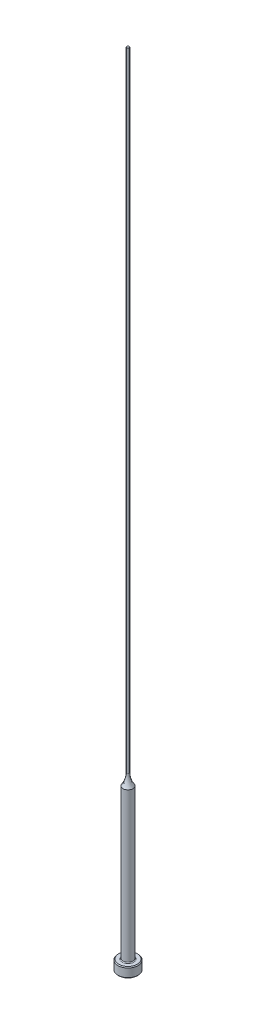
ISO-10303-21;
HEADER;
FILE_DESCRIPTION(('STEP AP214'),'2;1');
FILE_NAME('part.step','',(''),(''),'','','');
FILE_SCHEMA(('AUTOMOTIVE_DESIGN { 1 0 10303 214 1 1 1 1 }'));
ENDSEC;
DATA;
#1=APPLICATION_CONTEXT('core data for automotive mechanical design processes');
#2=APPLICATION_PROTOCOL_DEFINITION('international standard','automotive_design',2000,#1);
#3=PRODUCT_CONTEXT('',#1,'mechanical');
#4=PRODUCT('Part','Part','',(#3));
#5=PRODUCT_RELATED_PRODUCT_CATEGORY('part','',(#4));
#6=PRODUCT_DEFINITION_FORMATION('','',#4);
#7=PRODUCT_DEFINITION_CONTEXT('part definition',#1,'design');
#8=PRODUCT_DEFINITION('design','',#6,#7);
#9=PRODUCT_DEFINITION_SHAPE('','',#8);
#10=(LENGTH_UNIT() NAMED_UNIT(*) SI_UNIT(.MILLI.,.METRE.));
#11=(NAMED_UNIT(*) PLANE_ANGLE_UNIT() SI_UNIT($,.RADIAN.));
#12=(NAMED_UNIT(*) SI_UNIT($,.STERADIAN.) SOLID_ANGLE_UNIT());
#13=UNCERTAINTY_MEASURE_WITH_UNIT(LENGTH_MEASURE(1.E-05),#10,'distance_accuracy_value','');
#14=(GEOMETRIC_REPRESENTATION_CONTEXT(3) GLOBAL_UNCERTAINTY_ASSIGNED_CONTEXT((#13)) GLOBAL_UNIT_ASSIGNED_CONTEXT((#10,
#11,#12)) REPRESENTATION_CONTEXT('',''));
#15=CARTESIAN_POINT('',(0.,0.,0.));
#16=DIRECTION('',(0.,0.,1.));
#17=DIRECTION('',(1.,0.,0.));
#18=AXIS2_PLACEMENT_3D('',#15,#16,#17);
#19=CARTESIAN_POINT('',(-0.396239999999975,254.,0.));
#20=DIRECTION('',(0.,1.,0.));
#21=DIRECTION('',(0.,0.,1.));
#22=AXIS2_PLACEMENT_3D('',#19,#20,#21);
#23=PLANE('',#22);
#24=CARTESIAN_POINT('',(0.,254.,0.));
#25=DIRECTION('',(0.,1.,0.));
#26=DIRECTION('',(0.,0.,1.));
#27=AXIS2_PLACEMENT_3D('',#24,#25,#26);
#28=CIRCLE('',#27,0.396239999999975);
#29=CARTESIAN_POINT('',(0.,254.,0.396239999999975));
#30=VERTEX_POINT('',#29);
#31=EDGE_CURVE('E61',#30,#30,#28,.T.);
#32=ORIENTED_EDGE('',*,*,#31,.T.);
#33=EDGE_LOOP('',(#32));
#34=FACE_BOUND('',#33,.T.);
#35=ADVANCED_FACE('F35',(#34),#23,.T.);
#36=CARTESIAN_POINT('',(0.,259.958771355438,0.));
#37=DIRECTION('',(0.,1.,0.));
#38=DIRECTION('',(0.,0.,1.));
#39=AXIS2_PLACEMENT_3D('',#36,#37,#38);
#40=CYLINDRICAL_SURFACE('',#39,0.396239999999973);
#41=CARTESIAN_POINT('',(0.,54.5026884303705,0.));
#42=DIRECTION('',(0.,1.,0.));
#43=DIRECTION('',(0.,0.,1.));
#44=AXIS2_PLACEMENT_3D('',#41,#42,#43);
#45=CIRCLE('',#44,0.396239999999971);
#46=CARTESIAN_POINT('',(0.,54.5026884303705,0.396239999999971));
#47=VERTEX_POINT('',#46);
#48=EDGE_CURVE('E64',#47,#47,#45,.T.);
#49=ORIENTED_EDGE('',*,*,#48,.T.);
#50=EDGE_LOOP('',(#49));
#51=FACE_BOUND('',#50,.T.);
#52=ORIENTED_EDGE('',*,*,#31,.F.);
#53=EDGE_LOOP('',(#52));
#54=FACE_BOUND('',#53,.T.);
#55=ADVANCED_FACE('F84',(#51,#54),#40,.T.);
#56=CARTESIAN_POINT('',(0.,54.5026884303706,0.));
#57=DIRECTION('',(0.,1.,0.));
#58=DIRECTION('',(0.,0.,1.));
#59=AXIS2_PLACEMENT_3D('',#56,#57,#58);
#60=TOROIDAL_SURFACE('',#59,6.74623999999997,6.35);
#61=CARTESIAN_POINT('',(0.,50.8,0.));
#62=DIRECTION('',(0.,1.,0.));
#63=DIRECTION('',(0.,0.,1.));
#64=AXIS2_PLACEMENT_3D('',#61,#62,#63);
#65=CIRCLE('',#64,1.58749999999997);
#66=CARTESIAN_POINT('',(0.,50.8,1.58749999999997));
#67=VERTEX_POINT('',#66);
#68=EDGE_CURVE('E67',#67,#67,#65,.T.);
#69=ORIENTED_EDGE('',*,*,#68,.T.);
#70=EDGE_LOOP('',(#69));
#71=FACE_BOUND('',#70,.T.);
#72=ORIENTED_EDGE('',*,*,#48,.F.);
#73=EDGE_LOOP('',(#72));
#74=FACE_BOUND('',#73,.T.);
#75=ADVANCED_FACE('F71',(#71,#74),#60,.F.);
#76=CARTESIAN_POINT('',(0.,259.958771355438,0.));
#77=DIRECTION('',(0.,1.,0.));
#78=DIRECTION('',(0.,0.,1.));
#79=AXIS2_PLACEMENT_3D('',#76,#77,#78);
#80=CYLINDRICAL_SURFACE('',#79,1.58749999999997);
#81=CARTESIAN_POINT('',(0.,3.42900000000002,0.));
#82=DIRECTION('',(0.,1.,0.));
#83=DIRECTION('',(0.,0.,1.));
#84=AXIS2_PLACEMENT_3D('',#81,#82,#83);
#85=CIRCLE('',#84,1.58749999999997);
#86=CARTESIAN_POINT('',(0.,3.42900000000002,1.58749999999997));
#87=VERTEX_POINT('',#86);
#88=EDGE_CURVE('E42',#87,#87,#85,.T.);
#89=ORIENTED_EDGE('',*,*,#88,.T.);
#90=EDGE_LOOP('',(#89));
#91=FACE_BOUND('',#90,.T.);
#92=ORIENTED_EDGE('',*,*,#68,.F.);
#93=EDGE_LOOP('',(#92));
#94=FACE_BOUND('',#93,.T.);
#95=ADVANCED_FACE('F74',(#91,#94),#80,.T.);
#96=CARTESIAN_POINT('',(-3.17499999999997,3.175,0.));
#97=DIRECTION('',(0.,1.,0.));
#98=DIRECTION('',(0.,0.,1.));
#99=AXIS2_PLACEMENT_3D('',#96,#97,#98);
#100=PLANE('',#99);
#101=CARTESIAN_POINT('',(0.,3.175,0.));
#102=DIRECTION('',(0.,1.,0.));
#103=DIRECTION('',(0.,0.,1.));
#104=AXIS2_PLACEMENT_3D('',#101,#102,#103);
#105=CIRCLE('',#104,1.84149999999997);
#106=CARTESIAN_POINT('',(0.,3.175,1.84149999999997));
#107=VERTEX_POINT('',#106);
#108=EDGE_CURVE('E10',#107,#107,#105,.F.);
#109=ORIENTED_EDGE('',*,*,#108,.T.);
#110=EDGE_LOOP('',(#109));
#111=FACE_BOUND('',#110,.T.);
#112=CARTESIAN_POINT('',(0.,3.175,0.));
#113=DIRECTION('',(0.,1.,0.));
#114=DIRECTION('',(0.,0.,1.));
#115=AXIS2_PLACEMENT_3D('',#112,#113,#114);
#116=CIRCLE('',#115,2.92099999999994);
#117=CARTESIAN_POINT('',(0.,3.175,2.92099999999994));
#118=VERTEX_POINT('',#117);
#119=EDGE_CURVE('E58',#118,#118,#116,.T.);
#120=ORIENTED_EDGE('',*,*,#119,.T.);
#121=EDGE_LOOP('',(#120));
#122=FACE_BOUND('',#121,.T.);
#123=ADVANCED_FACE('F76',(#111,#122),#100,.T.);
#124=CARTESIAN_POINT('',(0.,259.958771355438,0.));
#125=DIRECTION('',(0.,1.,0.));
#126=DIRECTION('',(0.,0.,1.));
#127=AXIS2_PLACEMENT_3D('',#124,#125,#126);
#128=CYLINDRICAL_SURFACE('',#127,3.17499999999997);
#129=CARTESIAN_POINT('',(0.,2.92100000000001,0.));
#130=DIRECTION('',(0.,1.,0.));
#131=DIRECTION('',(0.,0.,1.));
#132=AXIS2_PLACEMENT_3D('',#129,#130,#131);
#133=CIRCLE('',#132,3.17499999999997);
#134=CARTESIAN_POINT('',(0.,2.92100000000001,3.17499999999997));
#135=VERTEX_POINT('',#134);
#136=EDGE_CURVE('E50',#135,#135,#133,.F.);
#137=ORIENTED_EDGE('',*,*,#136,.T.);
#138=EDGE_LOOP('',(#137));
#139=FACE_BOUND('',#138,.T.);
#140=CARTESIAN_POINT('',(0.,0.253999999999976,0.));
#141=DIRECTION('',(0.,-1.,0.));
#142=DIRECTION('',(0.,0.,-1.));
#143=AXIS2_PLACEMENT_3D('',#140,#141,#142);
#144=CIRCLE('',#143,3.17499999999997);
#145=CARTESIAN_POINT('',(0.,0.253999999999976,-3.17499999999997));
#146=VERTEX_POINT('',#145);
#147=EDGE_CURVE('E55',#146,#146,#144,.F.);
#148=ORIENTED_EDGE('',*,*,#147,.T.);
#149=EDGE_LOOP('',(#148));
#150=FACE_BOUND('',#149,.T.);
#151=ADVANCED_FACE('F82',(#139,#150),#128,.T.);
#152=CARTESIAN_POINT('',(0.,0.,0.));
#153=DIRECTION('',(0.,-1.,0.));
#154=DIRECTION('',(0.,0.,-1.));
#155=AXIS2_PLACEMENT_3D('',#152,#153,#154);
#156=PLANE('',#155);
#157=CARTESIAN_POINT('',(0.,0.,0.));
#158=DIRECTION('',(0.,-1.,0.));
#159=DIRECTION('',(0.,0.,-1.));
#160=AXIS2_PLACEMENT_3D('',#157,#158,#159);
#161=CIRCLE('',#160,2.92100000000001);
#162=CARTESIAN_POINT('',(0.,0.,-2.92100000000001));
#163=VERTEX_POINT('',#162);
#164=EDGE_CURVE('E46',#163,#163,#161,.T.);
#165=ORIENTED_EDGE('',*,*,#164,.T.);
#166=EDGE_LOOP('',(#165));
#167=FACE_BOUND('',#166,.T.);
#168=ADVANCED_FACE('F98',(#167),#156,.T.);
#169=CARTESIAN_POINT('',(0.,3.17499999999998,0.));
#170=DIRECTION('',(0.,-1.,0.));
#171=DIRECTION('',(0.,0.,-1.));
#172=AXIS2_PLACEMENT_3D('',#169,#170,#171);
#173=CONICAL_SURFACE('',#172,2.92099999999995,0.785398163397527);
#174=ORIENTED_EDGE('',*,*,#136,.F.);
#175=EDGE_LOOP('',(#174));
#176=FACE_BOUND('',#175,.T.);
#177=ORIENTED_EDGE('',*,*,#119,.F.);
#178=EDGE_LOOP('',(#177));
#179=FACE_BOUND('',#178,.T.);
#180=ADVANCED_FACE('F95',(#176,#179),#173,.T.);
#181=CARTESIAN_POINT('',(0.,0.253999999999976,0.));
#182=DIRECTION('',(0.,1.,0.));
#183=DIRECTION('',(0.,0.,1.));
#184=AXIS2_PLACEMENT_3D('',#181,#182,#183);
#185=CONICAL_SURFACE('',#184,3.17499999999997,0.785398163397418);
#186=ORIENTED_EDGE('',*,*,#164,.F.);
#187=EDGE_LOOP('',(#186));
#188=FACE_BOUND('',#187,.T.);
#189=ORIENTED_EDGE('',*,*,#147,.F.);
#190=EDGE_LOOP('',(#189));
#191=FACE_BOUND('',#190,.T.);
#192=ADVANCED_FACE('F97',(#188,#191),#185,.T.);
#193=CARTESIAN_POINT('',(0.,3.42900000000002,0.));
#194=DIRECTION('',(0.,1.,0.));
#195=DIRECTION('',(0.,0.,1.));
#196=AXIS2_PLACEMENT_3D('',#193,#194,#195);
#197=TOROIDAL_SURFACE('',#196,1.84149999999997,0.254);
#198=ORIENTED_EDGE('',*,*,#108,.F.);
#199=EDGE_LOOP('',(#198));
#200=FACE_BOUND('',#199,.T.);
#201=ORIENTED_EDGE('',*,*,#88,.F.);
#202=EDGE_LOOP('',(#201));
#203=FACE_BOUND('',#202,.T.);
#204=ADVANCED_FACE('F37',(#200,#203),#197,.F.);
#205=CLOSED_SHELL('',(#35,#55,#75,#95,#123,#151,#168,#180,#192,#204));
#206=MANIFOLD_SOLID_BREP('B2',#205);
#207=ADVANCED_BREP_SHAPE_REPRESENTATION('',(#18,#206),#14);
#208=SHAPE_DEFINITION_REPRESENTATION(#9,#207);
ENDSEC;
END-ISO-10303-21;
